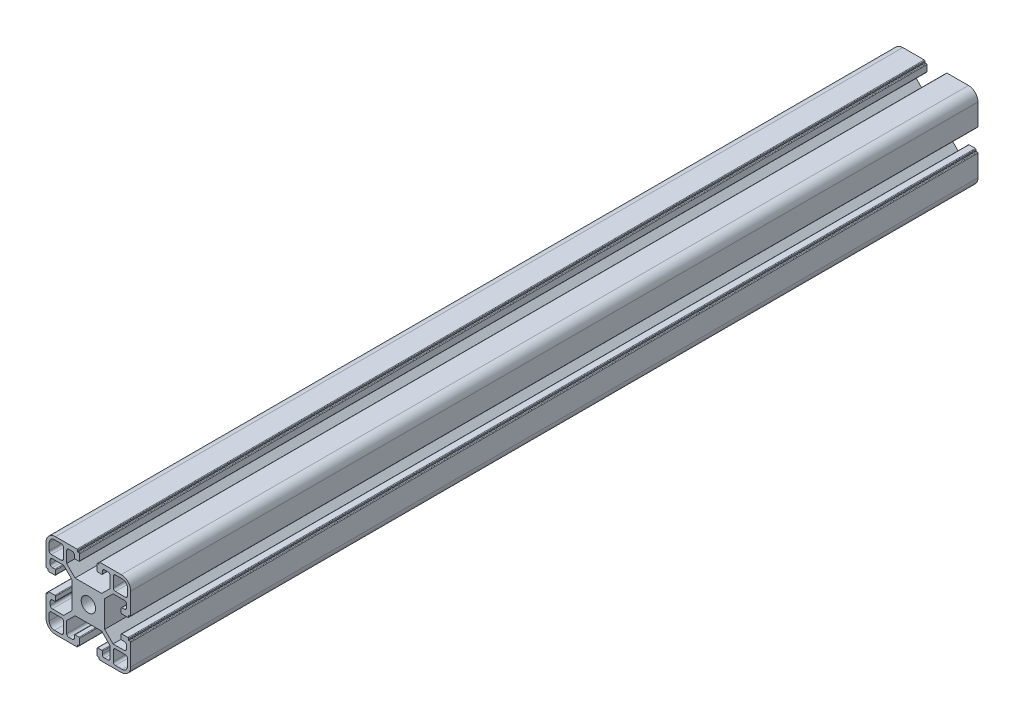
from build123d import *

# Parameters (mm, degrees)
ESQUISSE1_R      = 3.4
EXTRUSION1_DEPTH = 400


with BuildPart() as part:
    # Esquisse1 → Extrusion1 (new body)
    with BuildSketch(Plane.XY):
        with BuildLine():
            Line((0.801718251, -6.406132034), (0.801718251, 6.165440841))
            Line((0.801718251, 6.165440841), (-3.162495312, 10.129654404))
            Line((-3.162495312, 10.129654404), (-8.498281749, 10.129654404))
            ThreePointArc((-8.498281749, 10.129654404), (-9.205388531, 9.836761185), (-9.498281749, 9.129654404))
            Line((-9.498281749, 9.129654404), (-9.498281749, 7.479654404))
            ThreePointArc((-9.498281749, 7.479654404), (-9.205388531, 6.772547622), (-8.498281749, 6.479654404))
            Line((-8.498281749, 6.479654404), (-7.298281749, 6.479654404))
            ThreePointArc((-7.298281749, 6.479654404), (-7.086149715, 6.391786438), (-6.998281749, 6.179654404))
            Line((-6.998281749, 6.179654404), (-6.998281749, 4.279654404))
            ThreePointArc((-6.998281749, 4.279654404), (-7.086149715, 4.067522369), (-7.298281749, 3.979654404))
            Line((-7.298281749, 3.979654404), (-10.198281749, 3.979654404))
            ThreePointArc((-10.198281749, 3.979654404), (-10.410413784, 4.067522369), (-10.498281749, 4.279654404))
            Line((-10.498281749, 4.279654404), (-10.498281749, 4.779654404))
            ThreePointArc((-10.498281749, 4.779654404), (-10.556860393, 4.92107576), (-10.698281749, 4.979654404))
            Line((-10.698281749, 4.979654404), (-11.198281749, 4.979654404))
            ThreePointArc((-11.198281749, 4.979654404), (-11.410413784, 5.067522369), (-11.498281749, 5.279654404))
            Line((-11.498281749, 5.279654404), (-11.498281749, 15.379654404))
            ThreePointArc((-11.498281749, 15.379654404), (-10.180262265, 18.561634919), (-6.998281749, 19.879654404))
            Line((-6.998281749, 19.879654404), (3.101718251, 19.879654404))
            ThreePointArc((3.101718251, 19.879654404), (3.313850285, 19.791786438), (3.401718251, 19.579654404))
            Line((3.401718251, 19.579654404), (3.401718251, 19.079654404))
            ThreePointArc((3.401718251, 19.079654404), (3.460296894, 18.938233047), (3.601718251, 18.879654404))
            Line((3.601718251, 18.879654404), (4.101718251, 18.879654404))
            ThreePointArc((4.101718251, 18.879654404), (4.313850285, 18.791786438), (4.401718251, 18.579654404))
            Line((4.401718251, 18.579654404), (4.401718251, 15.679654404))
            ThreePointArc((4.401718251, 15.679654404), (4.313850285, 15.467522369), (4.101718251, 15.379654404))
            Line((4.101718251, 15.379654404), (2.201718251, 15.379654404))
            ThreePointArc((2.201718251, 15.379654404), (1.989586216, 15.467522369), (1.901718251, 15.679654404))
            Line((1.901718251, 15.679654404), (1.901718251, 16.879654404))
            ThreePointArc((1.901718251, 16.879654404), (1.608825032, 17.586761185), (0.901718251, 17.879654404))
            Line((0.901718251, 17.879654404), (-0.748281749, 17.879654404))
            ThreePointArc((-0.748281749, 17.879654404), (-1.455388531, 17.586761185), (-1.748281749, 16.879654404))
            Line((-1.748281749, 16.879654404), (-1.748281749, 11.543867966))
            Line((-1.748281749, 11.543867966), (2.215931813, 7.579654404))
            Line((2.215931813, 7.579654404), (14.787504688, 7.579654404))
            Line((14.787504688, 7.579654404), (18.751718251, 11.543867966))
            Line((18.751718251, 11.543867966), (18.751718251, 16.879654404))
            ThreePointArc((18.751718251, 16.879654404), (18.458825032, 17.586761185), (17.751718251, 17.879654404))
            Line((17.751718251, 17.879654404), (16.101718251, 17.879654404))
            ThreePointArc((16.101718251, 17.879654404), (15.394611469, 17.586761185), (15.101718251, 16.879654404))
            Line((15.101718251, 16.879654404), (15.101718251, 15.679654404))
            ThreePointArc((15.101718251, 15.679654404), (15.013850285, 15.467522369), (14.801718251, 15.379654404))
            Line((14.801718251, 15.379654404), (12.901718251, 15.379654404))
            ThreePointArc((12.901718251, 15.379654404), (12.689586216, 15.467522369), (12.601718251, 15.679654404))
            Line((12.601718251, 15.679654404), (12.601718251, 18.579654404))
            ThreePointArc((12.601718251, 18.579654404), (12.689586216, 18.791786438), (12.901718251, 18.879654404))
            Line((12.901718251, 18.879654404), (13.401718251, 18.879654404))
            ThreePointArc((13.401718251, 18.879654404), (13.543139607, 18.938233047), (13.601718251, 19.079654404))
            Line((13.601718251, 19.079654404), (13.601718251, 19.579654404))
            ThreePointArc((13.601718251, 19.579654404), (13.689586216, 19.791786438), (13.901718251, 19.879654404))
            Line((13.901718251, 19.879654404), (24.001718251, 19.879654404))
            ThreePointArc((24.001718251, 19.879654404), (27.183698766, 18.561634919), (28.501718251, 15.379654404))
            Line((28.501718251, 15.379654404), (28.501718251, 5.279654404))
            ThreePointArc((28.501718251, 5.279654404), (28.413850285, 5.067522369), (28.201718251, 4.979654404))
            Line((28.201718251, 4.979654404), (27.701718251, 4.979654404))
            ThreePointArc((27.701718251, 4.979654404), (27.560296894, 4.92107576), (27.501718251, 4.779654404))
            Line((27.501718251, 4.779654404), (27.501718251, 4.279654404))
            ThreePointArc((27.501718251, 4.279654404), (27.413850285, 4.067522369), (27.201718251, 3.979654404))
            Line((27.201718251, 3.979654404), (24.301718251, 3.979654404))
            ThreePointArc((24.301718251, 3.979654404), (24.089586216, 4.067522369), (24.001718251, 4.279654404))
            Line((24.001718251, 4.279654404), (24.001718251, 6.179654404))
            ThreePointArc((24.001718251, 6.179654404), (24.089586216, 6.391786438), (24.301718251, 6.479654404))
            Line((24.301718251, 6.479654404), (25.501718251, 6.479654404))
            ThreePointArc((25.501718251, 6.479654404), (26.208825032, 6.772547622), (26.501718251, 7.479654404))
            Line((26.501718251, 7.479654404), (26.501718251, 9.129654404))
            ThreePointArc((26.501718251, 9.129654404), (26.208825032, 9.836761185), (25.501718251, 10.129654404))
            Line((25.501718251, 10.129654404), (20.165931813, 10.129654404))
            Line((20.165931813, 10.129654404), (16.201718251, 6.165440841))
            Line((16.201718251, 6.165440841), (16.201718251, -6.406132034))
            Line((16.201718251, -6.406132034), (20.165931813, -10.370345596))
            Line((20.165931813, -10.370345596), (25.501718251, -10.370345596))
            ThreePointArc((25.501718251, -10.370345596), (26.208825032, -10.077452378), (26.501718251, -9.370345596))
            Line((26.501718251, -9.370345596), (26.501718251, -7.720345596))
            ThreePointArc((26.501718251, -7.720345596), (26.208825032, -7.013238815), (25.501718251, -6.720345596))
            Line((25.501718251, -6.720345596), (24.301718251, -6.720345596))
            ThreePointArc((24.301718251, -6.720345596), (24.089586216, -6.632477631), (24.001718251, -6.420345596))
            Line((24.001718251, -6.420345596), (24.001718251, -4.520345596))
            ThreePointArc((24.001718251, -4.520345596), (24.089586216, -4.308213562), (24.301718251, -4.220345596))
            Line((24.301718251, -4.220345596), (27.201718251, -4.220345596))
            ThreePointArc((27.201718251, -4.220345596), (27.413850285, -4.308213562), (27.501718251, -4.520345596))
            Line((27.501718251, -4.520345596), (27.501718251, -5.020345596))
            ThreePointArc((27.501718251, -5.020345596), (27.560296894, -5.161766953), (27.701718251, -5.220345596))
            Line((27.701718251, -5.220345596), (28.201718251, -5.220345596))
            ThreePointArc((28.201718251, -5.220345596), (28.413850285, -5.308213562), (28.501718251, -5.520345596))
            Line((28.501718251, -5.520345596), (28.501718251, -15.620345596))
            ThreePointArc((28.501718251, -15.620345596), (27.183698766, -18.802326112), (24.001718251, -20.120345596))
            Line((24.001718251, -20.120345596), (13.901718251, -20.120345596))
            ThreePointArc((13.901718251, -20.120345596), (13.689586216, -20.032477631), (13.601718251, -19.820345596))
            Line((13.601718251, -19.820345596), (13.601718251, -19.320345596))
            ThreePointArc((13.601718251, -19.320345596), (13.543139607, -19.17892424), (13.401718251, -19.120345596))
            Line((13.401718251, -19.120345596), (12.901718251, -19.120345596))
            ThreePointArc((12.901718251, -19.120345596), (12.689586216, -19.032477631), (12.601718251, -18.820345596))
            Line((12.601718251, -18.820345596), (12.601718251, -15.920345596))
            ThreePointArc((12.601718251, -15.920345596), (12.689586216, -15.708213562), (12.901718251, -15.620345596))
            Line((12.901718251, -15.620345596), (14.801718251, -15.620345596))
            ThreePointArc((14.801718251, -15.620345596), (15.013850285, -15.708213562), (15.101718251, -15.920345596))
            Line((15.101718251, -15.920345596), (15.101718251, -17.120345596))
            ThreePointArc((15.101718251, -17.120345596), (15.394611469, -17.827452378), (16.101718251, -18.120345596))
            Line((16.101718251, -18.120345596), (17.751718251, -18.120345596))
            ThreePointArc((17.751718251, -18.120345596), (18.458825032, -17.827452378), (18.751718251, -17.120345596))
            Line((18.751718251, -17.120345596), (18.751718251, -11.784559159))
            Line((18.751718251, -11.784559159), (14.787504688, -7.820345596))
            Line((14.787504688, -7.820345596), (2.215931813, -7.820345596))
            Line((2.215931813, -7.820345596), (-1.748281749, -11.784559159))
            Line((-1.748281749, -11.784559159), (-1.748281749, -17.120345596))
            ThreePointArc((-1.748281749, -17.120345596), (-1.455388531, -17.827452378), (-0.748281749, -18.120345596))
            Line((-0.748281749, -18.120345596), (0.901718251, -18.120345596))
            ThreePointArc((0.901718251, -18.120345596), (1.608825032, -17.827452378), (1.901718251, -17.120345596))
            Line((1.901718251, -17.120345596), (1.901718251, -15.920345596))
            ThreePointArc((1.901718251, -15.920345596), (1.989586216, -15.708213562), (2.201718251, -15.620345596))
            Line((2.201718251, -15.620345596), (4.101718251, -15.620345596))
            ThreePointArc((4.101718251, -15.620345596), (4.313850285, -15.708213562), (4.401718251, -15.920345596))
            Line((4.401718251, -15.920345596), (4.401718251, -18.820345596))
            ThreePointArc((4.401718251, -18.820345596), (4.313850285, -19.032477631), (4.101718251, -19.120345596))
            Line((4.101718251, -19.120345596), (3.601718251, -19.120345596))
            ThreePointArc((3.601718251, -19.120345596), (3.460296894, -19.17892424), (3.401718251, -19.320345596))
            Line((3.401718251, -19.320345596), (3.401718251, -19.820345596))
            ThreePointArc((3.401718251, -19.820345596), (3.313850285, -20.032477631), (3.101718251, -20.120345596))
            Line((3.101718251, -20.120345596), (-6.998281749, -20.120345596))
            ThreePointArc((-6.998281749, -20.120345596), (-10.180262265, -18.802326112), (-11.498281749, -15.620345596))
            Line((-11.498281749, -15.620345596), (-11.498281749, -5.520345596))
            ThreePointArc((-11.498281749, -5.520345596), (-11.410413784, -5.308213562), (-11.198281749, -5.220345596))
            Line((-11.198281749, -5.220345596), (-10.698281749, -5.220345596))
            ThreePointArc((-10.698281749, -5.220345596), (-10.556860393, -5.161766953), (-10.498281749, -5.020345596))
            Line((-10.498281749, -5.020345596), (-10.498281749, -4.520345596))
            ThreePointArc((-10.498281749, -4.520345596), (-10.410413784, -4.308213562), (-10.198281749, -4.220345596))
            Line((-10.198281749, -4.220345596), (-7.298281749, -4.220345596))
            ThreePointArc((-7.298281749, -4.220345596), (-7.086149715, -4.308213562), (-6.998281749, -4.520345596))
            Line((-6.998281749, -4.520345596), (-6.998281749, -6.420345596))
            ThreePointArc((-6.998281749, -6.420345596), (-7.086149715, -6.632477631), (-7.298281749, -6.720345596))
            Line((-7.298281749, -6.720345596), (-8.498281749, -6.720345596))
            ThreePointArc((-8.498281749, -6.720345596), (-9.205388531, -7.013238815), (-9.498281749, -7.720345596))
            Line((-9.498281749, -7.720345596), (-9.498281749, -9.370345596))
            ThreePointArc((-9.498281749, -9.370345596), (-9.205388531, -10.077452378), (-8.498281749, -10.370345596))
            Line((-8.498281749, -10.370345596), (-3.162495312, -10.370345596))
            Line((-3.162495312, -10.370345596), (0.801718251, -6.406132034))
        make_face()
        with Locations((8.501718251, -0.120345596)):
            Circle(ESQUISSE1_R, mode=Mode.SUBTRACT)
        with BuildLine():
            Line((-4.248281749, 11.629654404), (-8.998281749, 11.629654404))
            ThreePointArc((-8.998281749, 11.629654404), (-9.705388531, 11.922547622), (-9.998281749, 12.629654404))
            Line((-9.998281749, 12.629654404), (-9.998281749, 15.879654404))
            ThreePointArc((-9.998281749, 15.879654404), (-9.266048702, 17.647421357), (-7.498281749, 18.379654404))
            Line((-7.498281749, 18.379654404), (-4.248281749, 18.379654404))
            ThreePointArc((-4.248281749, 18.379654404), (-3.541174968, 18.086761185), (-3.248281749, 17.379654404))
            Line((-3.248281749, 17.379654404), (-3.248281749, 12.629654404))
            ThreePointArc((-3.248281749, 12.629654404), (-3.541174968, 11.922547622), (-4.248281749, 11.629654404))
        make_face(mode=Mode.SUBTRACT)
        with BuildLine():
            Line((21.251718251, -11.870345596), (26.001718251, -11.870345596))
            ThreePointArc((26.001718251, -11.870345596), (26.708825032, -12.163238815), (27.001718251, -12.870345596))
            Line((27.001718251, -12.870345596), (27.001718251, -16.120345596))
            ThreePointArc((27.001718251, -16.120345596), (26.269485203, -17.888112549), (24.501718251, -18.620345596))
            Line((24.501718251, -18.620345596), (21.251718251, -18.620345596))
            ThreePointArc((21.251718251, -18.620345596), (20.544611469, -18.327452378), (20.251718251, -17.620345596))
            Line((20.251718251, -17.620345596), (20.251718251, -12.870345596))
            ThreePointArc((20.251718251, -12.870345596), (20.544611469, -12.163238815), (21.251718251, -11.870345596))
        make_face(mode=Mode.SUBTRACT)
        with BuildLine():
            Line((-3.248281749, -12.870345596), (-3.248281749, -17.620345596))
            ThreePointArc((-3.248281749, -17.620345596), (-3.541174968, -18.327452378), (-4.248281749, -18.620345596))
            Line((-4.248281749, -18.620345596), (-7.498281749, -18.620345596))
            ThreePointArc((-7.498281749, -18.620345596), (-9.266048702, -17.888112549), (-9.998281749, -16.120345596))
            Line((-9.998281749, -16.120345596), (-9.998281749, -12.870345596))
            ThreePointArc((-9.998281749, -12.870345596), (-9.705388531, -12.163238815), (-8.998281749, -11.870345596))
            Line((-8.998281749, -11.870345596), (-4.248281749, -11.870345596))
            ThreePointArc((-4.248281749, -11.870345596), (-3.541174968, -12.163238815), (-3.248281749, -12.870345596))
        make_face(mode=Mode.SUBTRACT)
        with BuildLine():
            Line((27.001718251, 15.879654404), (27.001718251, 12.629654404))
            ThreePointArc((27.001718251, 12.629654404), (26.708825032, 11.922547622), (26.001718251, 11.629654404))
            Line((26.001718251, 11.629654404), (21.255345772, 11.629654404))
            Line((21.255345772, 11.629654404), (21.251718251, 11.629654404))
            ThreePointArc((21.251718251, 11.629654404), (20.544611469, 11.922547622), (20.251718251, 12.629654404))
            Line((20.251718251, 12.629654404), (20.251718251, 17.379654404))
            ThreePointArc((20.251718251, 17.379654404), (20.544611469, 18.086761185), (21.251718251, 18.379654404))
            Line((21.251718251, 18.379654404), (24.501718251, 18.379654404))
            ThreePointArc((24.501718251, 18.379654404), (26.269485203, 17.647421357), (27.001718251, 15.879654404))
        make_face(mode=Mode.SUBTRACT)
    extrude(amount=EXTRUSION1_DEPTH)


solid = part.part
